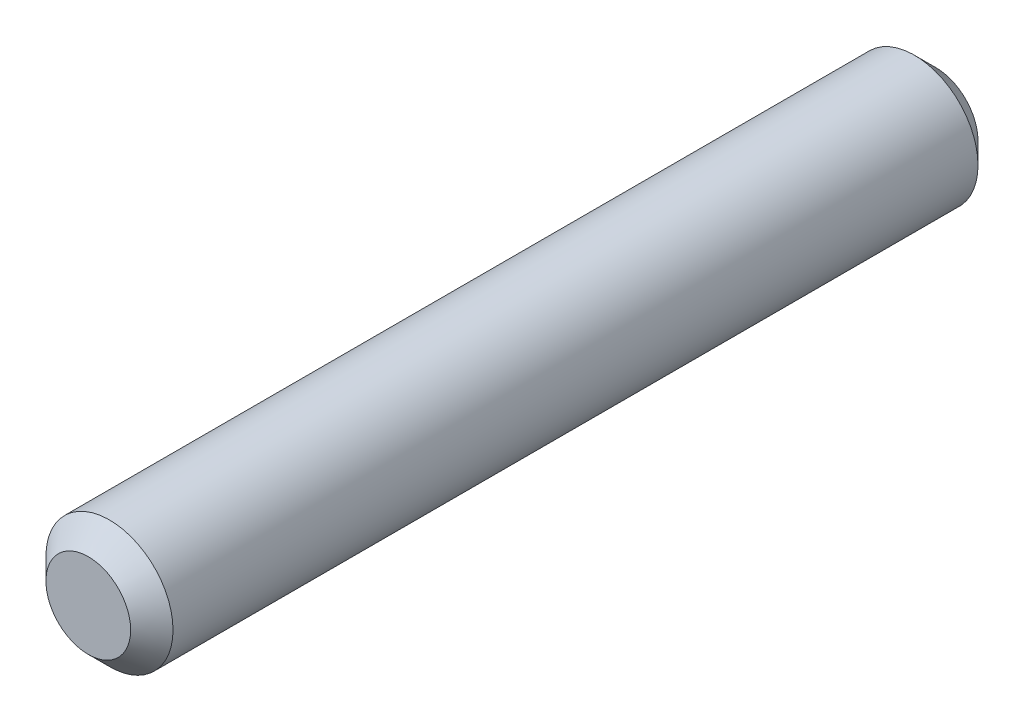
from build123d import *

# Parameters (mm, degrees)
SKETCH_2_R      = 0.75
EXTRUDE_1_DEPTH = 5
CHAMFER_1_SIZE  = 0.25


with BuildPart() as part:
    # Sketch 2 → Extrude 1 (new, symmetric)
    with BuildSketch(Plane.XY):
        Circle(SKETCH_2_R)
    extrude(amount=EXTRUDE_1_DEPTH, both=True)

    # Chamfer 1
    chamfer_1_edges = [part.edges().sort_by_distance(p)[0] for p in [
        (-0.75, 0, -5),
        (-0.75, 0, 5),
    ]]
    chamfer(chamfer_1_edges, length=CHAMFER_1_SIZE)


solid = part.part
